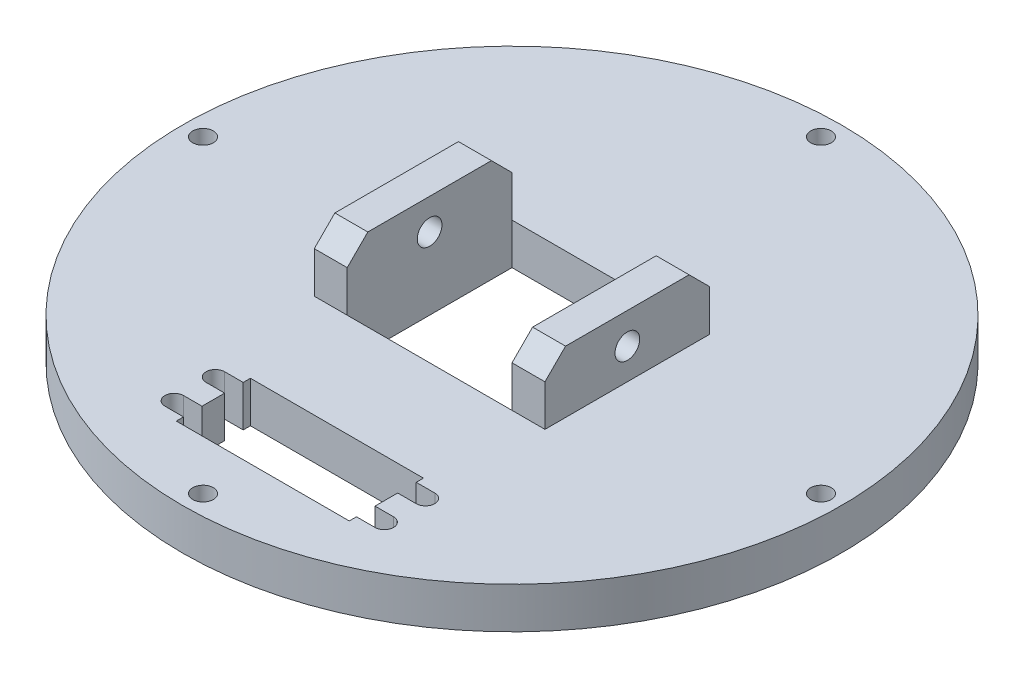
from build123d import *

# Parameters (mm, degrees)
SKETCH1_R               = 80
BOSS_EXTRUDE1_DEPTH     = 10
CUT_EXTRUDE1_REACH      = 115.578
SKETCH2_R               = 2.5
CUT_EXTRUDE2_REACH      = 115.578
SKETCH3_W               = 40
SKETCH3_H               = 40
CUT_EXTRUDE3_REACH      = 115.578
SKETCH5_W               = 8
SKETCH5_H               = 40
BOSS_EXTRUDE2_DEPTH     = 15
FILLET1_SIZE            = 5
CUT_EXTRUDE4_REACH      = 138.708
SKETCH6_R               = 3
FILLET1_OF_MIRROR1_SIZE = 5


with BuildPart() as part:
    # Sketch1 → Boss-Extrude1 (new body)
    with BuildSketch(Plane(origin=(0, 0, 0), x_dir=(1, 0, 0), z_dir=(0, 1, 0))):
        with Locations(Location((0, 0, 0), (0, 0, 270))):
            Circle(SKETCH1_R)
    extrude(amount=BOSS_EXTRUDE1_DEPTH)

    # Sketch2 → Cut-Extrude1 (cut, up to next)
    with BuildSketch(Plane(origin=(0, 10, 0), x_dir=(1, 0, 0), z_dir=(0, 1, 0)), mode=Mode.PRIVATE) as cut_extrude1_sk1:
        with Locations(Location((-75, 0, 0), (0, 0, 270))):
            Circle(SKETCH2_R)
    cut_extrude1_tool1 = extrude(cut_extrude1_sk1.sketch, amount=-CUT_EXTRUDE1_REACH, mode=Mode.PRIVATE) & part.part
    # Sketch2 → Cut-Extrude1 (cut, up to next)
    with BuildSketch(Plane(origin=(0, 10, 0), x_dir=(1, 0, 0), z_dir=(0, 1, 0)), mode=Mode.PRIVATE) as cut_extrude1_sk2:
        with Locations(Location((0, 75, 0), (0, 0, 270))):
            Circle(SKETCH2_R)
    cut_extrude1_tool2 = extrude(cut_extrude1_sk2.sketch, amount=-CUT_EXTRUDE1_REACH, mode=Mode.PRIVATE) & part.part
    # Sketch2 → Cut-Extrude1 (cut, up to next)
    with BuildSketch(Plane(origin=(0, 10, 0), x_dir=(1, 0, 0), z_dir=(0, 1, 0)), mode=Mode.PRIVATE) as cut_extrude1_sk3:
        with Locations(Location((75, 0, 0), (0, 0, 270))):
            Circle(SKETCH2_R)
    cut_extrude1_tool3 = extrude(cut_extrude1_sk3.sketch, amount=-CUT_EXTRUDE1_REACH, mode=Mode.PRIVATE) & part.part
    # Sketch2 → Cut-Extrude1 (cut, up to next)
    with BuildSketch(Plane(origin=(0, 10, 0), x_dir=(1, 0, 0), z_dir=(0, 1, 0)), mode=Mode.PRIVATE) as cut_extrude1_sk4:
        with Locations(Location((0, -75, 0), (0, 0, 270))):
            Circle(SKETCH2_R)
    cut_extrude1_tool4 = extrude(cut_extrude1_sk4.sketch, amount=-CUT_EXTRUDE1_REACH, mode=Mode.PRIVATE) & part.part
    add(cut_extrude1_tool1.solids().sort_by_distance((-75, 10, 0))[0], mode=Mode.SUBTRACT)
    add(cut_extrude1_tool2.solids().sort_by_distance((0, 10, -75))[0], mode=Mode.SUBTRACT)
    add(cut_extrude1_tool3.solids().sort_by_distance((75, 10, 0))[0], mode=Mode.SUBTRACT)
    add(cut_extrude1_tool4.solids().sort_by_distance((0, 10, 75))[0], mode=Mode.SUBTRACT)

    # Sketch3 → Cut-Extrude2 (cut, up to next)
    with BuildSketch(Plane(origin=(0, 10, 0), x_dir=(1, 0, 0), z_dir=(0, 1, 0)), mode=Mode.PRIVATE) as cut_extrude2_sk1:
        Rectangle(SKETCH3_W, SKETCH3_H)
    cut_extrude2_tool1 = extrude(cut_extrude2_sk1.sketch, amount=-CUT_EXTRUDE2_REACH, mode=Mode.PRIVATE) & part.part
    add(cut_extrude2_tool1.solids().sort_by_distance((0, 10, 0))[0], mode=Mode.SUBTRACT)

    # Sketch4 → Cut-Extrude3 (cut, up to next)
    with BuildSketch(Plane(origin=(0, 10, 0), x_dir=(1, 0, 0), z_dir=(0, 1, 0)), mode=Mode.PRIVATE) as cut_extrude3_sk1:
        with BuildLine():
            Line((23.5, -45), (-18.5, -45))
            Line((-18.5, -45), (-18.5, -46.75))
            Line((-18.5, -46.75), (-23, -46.75))
            ThreePointArc((-23, -46.75), (-25.25, -49), (-23, -51.25))
            Line((-23, -51.25), (-18.5, -51.25))
            Line((-18.5, -51.25), (-18.5, -56.75))
            Line((-18.5, -56.75), (-23, -56.75))
            ThreePointArc((-23, -56.75), (-25.25, -59), (-23, -61.25))
            Line((-23, -61.25), (-18.5, -61.25))
            Line((-18.5, -61.25), (-18.5, -63))
            Line((-18.5, -63), (23.5, -63))
            Line((23.5, -63), (23.5, -61.25))
            Line((23.5, -61.25), (28, -61.25))
            ThreePointArc((28, -61.25), (30.25, -59), (28, -56.75))
            Line((28, -56.75), (23.5, -56.75))
            Line((23.5, -56.75), (23.5, -51.25))
            Line((23.5, -51.25), (28, -51.25))
            ThreePointArc((28, -51.25), (30.25, -49), (28, -46.75))
            Line((28, -46.75), (23.5, -46.75))
            Line((23.5, -46.75), (23.5, -45))
        make_face()
    cut_extrude3_tool1 = extrude(cut_extrude3_sk1.sketch, amount=-CUT_EXTRUDE3_REACH, mode=Mode.PRIVATE) & part.part
    add(cut_extrude3_tool1.solids().sort_by_distance((2.5, 10, 54))[0], mode=Mode.SUBTRACT)

    # Sketch5 → Boss-Extrude2 (add)
    with BuildSketch(Plane(origin=(0, 10, 0), x_dir=(1, 0, 0), z_dir=(0, 1, 0))):
        with Locations((-24, 0)):
            Rectangle(SKETCH5_W, SKETCH5_H)
    boss_extrude2 = extrude(amount=BOSS_EXTRUDE2_DEPTH)

    # Fillet1
    fillet1_edges = [part.edges().sort_by_distance(p)[0] for p in [
        (-24, 25, -20),
        (-24, 25, 20),
    ]]
    chamfer(fillet1_edges, length=FILLET1_SIZE)

    # Sketch6 → Cut-Extrude4 (cut, up to next)
    with BuildSketch(Plane.ZY.offset(28), mode=Mode.PRIVATE) as cut_extrude4_sk1:
        with Locations((0, 17.5)):
            Circle(SKETCH6_R)
    cut_extrude4_tool1 = extrude(cut_extrude4_sk1.sketch, amount=-CUT_EXTRUDE4_REACH, mode=Mode.PRIVATE) & part.part
    cut_extrude4 = cut_extrude4_tool1.solids().sort_by_distance((-28, 17.5, 0))[0]
    add(cut_extrude4, mode=Mode.SUBTRACT)

    # Mirror1: Boss-Extrude2, Cut-Extrude4 across plane
    add(boss_extrude2.mirror(Plane.ZY))
    add(cut_extrude4.mirror(Plane.ZY), mode=Mode.SUBTRACT)

    # Fillet1 of Mirror1
    fillet1_of_mirror1_edges = [part.edges().sort_by_distance(p)[0] for p in [
        (24, 25, -20),
        (24, 25, 20),
    ]]
    chamfer(fillet1_of_mirror1_edges, length=FILLET1_OF_MIRROR1_SIZE)


solid = part.part
